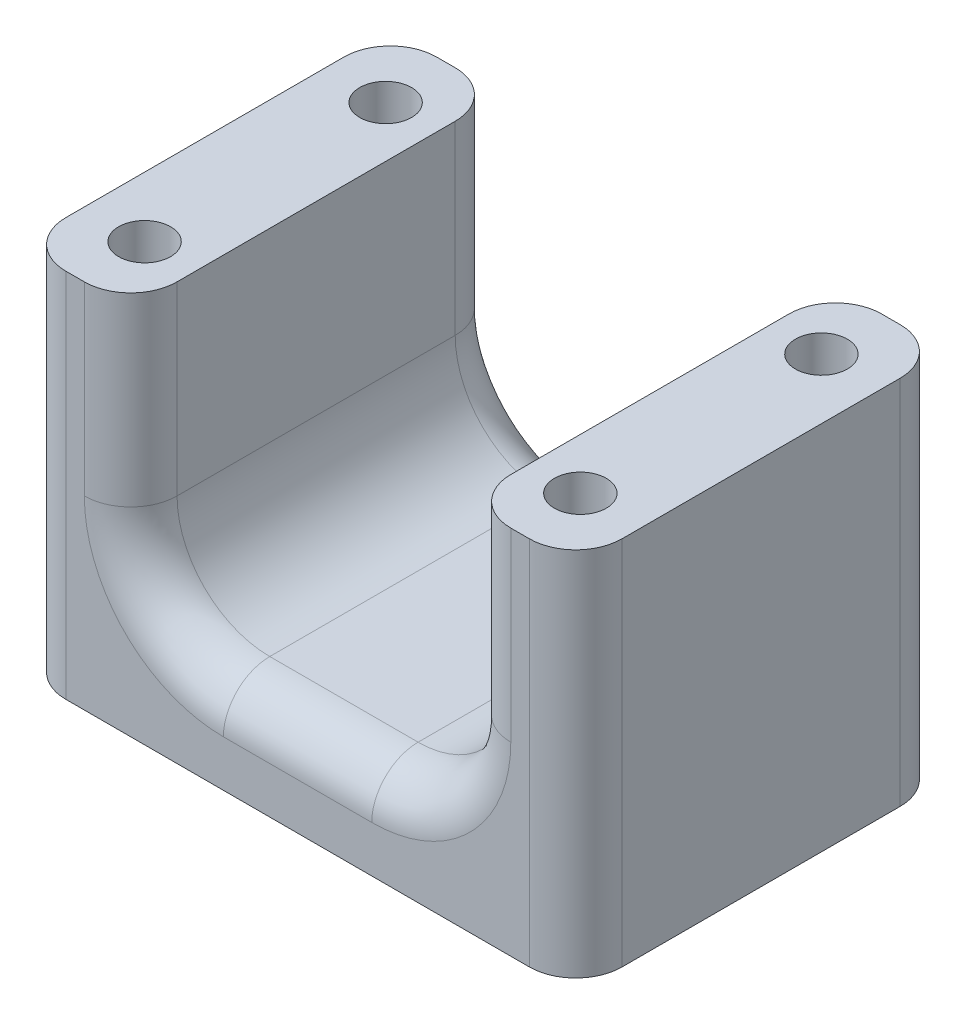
ISO-10303-21;
HEADER;
FILE_DESCRIPTION(('STEP AP214'),'2;1');
FILE_NAME('part.step','',(''),(''),'','','');
FILE_SCHEMA(('AUTOMOTIVE_DESIGN { 1 0 10303 214 1 1 1 1 }'));
ENDSEC;
DATA;
#1=APPLICATION_CONTEXT('core data for automotive mechanical design processes');
#2=APPLICATION_PROTOCOL_DEFINITION('international standard','automotive_design',2000,#1);
#3=PRODUCT_CONTEXT('',#1,'mechanical');
#4=PRODUCT('Part','Part','',(#3));
#5=PRODUCT_RELATED_PRODUCT_CATEGORY('part','',(#4));
#6=PRODUCT_DEFINITION_FORMATION('','',#4);
#7=PRODUCT_DEFINITION_CONTEXT('part definition',#1,'design');
#8=PRODUCT_DEFINITION('design','',#6,#7);
#9=PRODUCT_DEFINITION_SHAPE('','',#8);
#10=(LENGTH_UNIT() NAMED_UNIT(*) SI_UNIT(.MILLI.,.METRE.));
#11=(NAMED_UNIT(*) PLANE_ANGLE_UNIT() SI_UNIT($,.RADIAN.));
#12=(NAMED_UNIT(*) SI_UNIT($,.STERADIAN.) SOLID_ANGLE_UNIT());
#13=UNCERTAINTY_MEASURE_WITH_UNIT(LENGTH_MEASURE(1.E-05),#10,'distance_accuracy_value','');
#14=(GEOMETRIC_REPRESENTATION_CONTEXT(3) GLOBAL_UNCERTAINTY_ASSIGNED_CONTEXT((#13)) GLOBAL_UNIT_ASSIGNED_CONTEXT((#10,
#11,#12)) REPRESENTATION_CONTEXT('',''));
#15=CARTESIAN_POINT('',(0.,0.,0.));
#16=DIRECTION('',(0.,0.,1.));
#17=DIRECTION('',(1.,0.,0.));
#18=AXIS2_PLACEMENT_3D('',#15,#16,#17);
#19=CARTESIAN_POINT('',(0.,40.,0.));
#20=DIRECTION('',(0.,-1.,0.));
#21=DIRECTION('',(0.,0.,-1.));
#22=AXIS2_PLACEMENT_3D('',#19,#20,#21);
#23=PLANE('',#22);
#24=CARTESIAN_POINT('',(6.5,40.,-7.));
#25=DIRECTION('',(0.,1.,0.));
#26=DIRECTION('',(0.,0.,1.));
#27=AXIS2_PLACEMENT_3D('',#24,#25,#26);
#28=CIRCLE('',#27,2.8);
#29=CARTESIAN_POINT('',(6.5,40.,-4.2));
#30=VERTEX_POINT('',#29);
#31=EDGE_CURVE('E529',#30,#30,#28,.T.);
#32=ORIENTED_EDGE('',*,*,#31,.F.);
#33=EDGE_LOOP('',(#32));
#34=FACE_BOUND('',#33,.T.);
#35=CARTESIAN_POINT('',(6.49999999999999,40.,-33.));
#36=DIRECTION('',(0.,1.,0.));
#37=DIRECTION('',(0.,0.,1.));
#38=AXIS2_PLACEMENT_3D('',#35,#36,#37);
#39=CIRCLE('',#38,2.8);
#40=CARTESIAN_POINT('',(6.49999999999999,40.,-30.2));
#41=VERTEX_POINT('',#40);
#42=EDGE_CURVE('E528',#41,#41,#39,.T.);
#43=ORIENTED_EDGE('',*,*,#42,.F.);
#44=EDGE_LOOP('',(#43));
#45=FACE_BOUND('',#44,.T.);
#46=DIRECTION('',(0.,0.,1.));
#47=VECTOR('',#46,1.);
#48=CARTESIAN_POINT('',(12.,40.,-40.));
#49=LINE('',#48,#47);
#50=CARTESIAN_POINT('',(12.,40.,-35.));
#51=VERTEX_POINT('',#50);
#52=CARTESIAN_POINT('',(12.,40.,-5.00000000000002));
#53=VERTEX_POINT('',#52);
#54=EDGE_CURVE('E188',#51,#53,#49,.T.);
#55=ORIENTED_EDGE('',*,*,#54,.F.);
#56=CARTESIAN_POINT('',(7.,40.,-35.));
#57=DIRECTION('',(0.,-1.,0.));
#58=DIRECTION('',(0.,0.,-1.));
#59=AXIS2_PLACEMENT_3D('',#56,#57,#58);
#60=CIRCLE('',#59,5.);
#61=CARTESIAN_POINT('',(7.,40.,-40.));
#62=VERTEX_POINT('',#61);
#63=EDGE_CURVE('E183',#51,#62,#60,.F.);
#64=ORIENTED_EDGE('',*,*,#63,.T.);
#65=DIRECTION('',(-1.,0.,0.));
#66=VECTOR('',#65,1.);
#67=CARTESIAN_POINT('',(0.,40.,-40.));
#68=LINE('',#67,#66);
#69=CARTESIAN_POINT('',(5.,40.,-40.));
#70=VERTEX_POINT('',#69);
#71=EDGE_CURVE('E185',#62,#70,#68,.T.);
#72=ORIENTED_EDGE('',*,*,#71,.T.);
#73=CARTESIAN_POINT('',(5.,40.,-35.));
#74=DIRECTION('',(0.,-1.,0.));
#75=DIRECTION('',(0.,0.,-1.));
#76=AXIS2_PLACEMENT_3D('',#73,#74,#75);
#77=CIRCLE('',#76,5.);
#78=CARTESIAN_POINT('',(0.,40.,-35.));
#79=VERTEX_POINT('',#78);
#80=EDGE_CURVE('E265',#70,#79,#77,.F.);
#81=ORIENTED_EDGE('',*,*,#80,.T.);
#82=DIRECTION('',(0.,0.,1.));
#83=VECTOR('',#82,1.);
#84=CARTESIAN_POINT('',(0.,40.,0.));
#85=LINE('',#84,#83);
#86=CARTESIAN_POINT('',(0.,40.,-5.));
#87=VERTEX_POINT('',#86);
#88=EDGE_CURVE('E390',#79,#87,#85,.T.);
#89=ORIENTED_EDGE('',*,*,#88,.T.);
#90=CARTESIAN_POINT('',(5.,40.,-5.));
#91=DIRECTION('',(0.,-1.,0.));
#92=DIRECTION('',(0.,0.,-1.));
#93=AXIS2_PLACEMENT_3D('',#90,#91,#92);
#94=CIRCLE('',#93,5.);
#95=CARTESIAN_POINT('',(5.,40.,0.));
#96=VERTEX_POINT('',#95);
#97=EDGE_CURVE('E262',#87,#96,#94,.F.);
#98=ORIENTED_EDGE('',*,*,#97,.T.);
#99=DIRECTION('',(1.,0.,0.));
#100=VECTOR('',#99,1.);
#101=CARTESIAN_POINT('',(0.,40.,0.));
#102=LINE('',#101,#100);
#103=CARTESIAN_POINT('',(7.00000000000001,40.,0.));
#104=VERTEX_POINT('',#103);
#105=EDGE_CURVE('E396',#96,#104,#102,.T.);
#106=ORIENTED_EDGE('',*,*,#105,.T.);
#107=CARTESIAN_POINT('',(7.00000000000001,40.,-5.));
#108=DIRECTION('',(0.,-1.,0.));
#109=DIRECTION('',(0.,0.,-1.));
#110=AXIS2_PLACEMENT_3D('',#107,#108,#109);
#111=CIRCLE('',#110,5.);
#112=EDGE_CURVE('E194',#104,#53,#111,.F.);
#113=ORIENTED_EDGE('',*,*,#112,.T.);
#114=EDGE_LOOP('',(#55,#64,#72,#81,#89,#98,#106,#113));
#115=FACE_BOUND('',#114,.T.);
#116=ADVANCED_FACE('F41',(#34,#45,#115),#23,.F.);
#117=CARTESIAN_POINT('',(0.,40.,0.));
#118=DIRECTION('',(1.,0.,0.));
#119=DIRECTION('',(0.,0.,-1.));
#120=AXIS2_PLACEMENT_3D('',#117,#118,#119);
#121=PLANE('',#120);
#122=ORIENTED_EDGE('',*,*,#88,.F.);
#123=DIRECTION('',(0.,-1.,0.));
#124=VECTOR('',#123,1.);
#125=CARTESIAN_POINT('',(0.,40.,-35.));
#126=LINE('',#125,#124);
#127=CARTESIAN_POINT('',(0.,0.,-35.));
#128=VERTEX_POINT('',#127);
#129=EDGE_CURVE('E301',#79,#128,#126,.T.);
#130=ORIENTED_EDGE('',*,*,#129,.T.);
#131=DIRECTION('',(0.,0.,1.));
#132=VECTOR('',#131,1.);
#133=CARTESIAN_POINT('',(0.,0.,0.));
#134=LINE('',#133,#132);
#135=CARTESIAN_POINT('',(0.,0.,-5.));
#136=VERTEX_POINT('',#135);
#137=EDGE_CURVE('E379',#128,#136,#134,.T.);
#138=ORIENTED_EDGE('',*,*,#137,.T.);
#139=DIRECTION('',(0.,-1.,0.));
#140=VECTOR('',#139,1.);
#141=CARTESIAN_POINT('',(0.,40.,-5.));
#142=LINE('',#141,#140);
#143=EDGE_CURVE('E298',#136,#87,#142,.F.);
#144=ORIENTED_EDGE('',*,*,#143,.T.);
#145=EDGE_LOOP('',(#122,#130,#138,#144));
#146=FACE_BOUND('',#145,.T.);
#147=ADVANCED_FACE('F454',(#146),#121,.F.);
#148=CARTESIAN_POINT('',(0.,40.,0.));
#149=DIRECTION('',(0.,0.,-1.));
#150=DIRECTION('',(-1.,0.,0.));
#151=AXIS2_PLACEMENT_3D('',#148,#149,#150);
#152=PLANE('',#151);
#153=ORIENTED_EDGE('',*,*,#105,.F.);
#154=DIRECTION('',(0.,-1.,0.));
#155=VECTOR('',#154,1.);
#156=CARTESIAN_POINT('',(5.,40.,0.));
#157=LINE('',#156,#155);
#158=CARTESIAN_POINT('',(5.,0.,0.));
#159=VERTEX_POINT('',#158);
#160=EDGE_CURVE('E294',#96,#159,#157,.T.);
#161=ORIENTED_EDGE('',*,*,#160,.T.);
#162=DIRECTION('',(1.,0.,0.));
#163=VECTOR('',#162,1.);
#164=CARTESIAN_POINT('',(0.,0.,0.));
#165=LINE('',#164,#163);
#166=CARTESIAN_POINT('',(55.,0.,0.));
#167=VERTEX_POINT('',#166);
#168=EDGE_CURVE('E384',#159,#167,#165,.T.);
#169=ORIENTED_EDGE('',*,*,#168,.T.);
#170=DIRECTION('',(0.,-1.,0.));
#171=VECTOR('',#170,1.);
#172=CARTESIAN_POINT('',(55.,40.,0.));
#173=LINE('',#172,#171);
#174=CARTESIAN_POINT('',(55.,40.,0.));
#175=VERTEX_POINT('',#174);
#176=EDGE_CURVE('E291',#167,#175,#173,.F.);
#177=ORIENTED_EDGE('',*,*,#176,.T.);
#178=CARTESIAN_POINT('',(53.,40.,0.));
#179=VERTEX_POINT('',#178);
#180=EDGE_CURVE('E394',#179,#175,#102,.T.);
#181=ORIENTED_EDGE('',*,*,#180,.F.);
#182=DIRECTION('',(0.,1.,0.));
#183=VECTOR('',#182,1.);
#184=CARTESIAN_POINT('',(53.,40.,0.));
#185=LINE('',#184,#183);
#186=CARTESIAN_POINT('',(53.,20.,0.));
#187=VERTEX_POINT('',#186);
#188=EDGE_CURVE('E281',#179,#187,#185,.F.);
#189=ORIENTED_EDGE('',*,*,#188,.T.);
#190=CARTESIAN_POINT('',(38.,20.,0.));
#191=DIRECTION('',(0.,0.,-1.));
#192=DIRECTION('',(-1.,0.,0.));
#193=AXIS2_PLACEMENT_3D('',#190,#191,#192);
#194=CIRCLE('',#193,15.);
#195=CARTESIAN_POINT('',(38.,5.,0.));
#196=VERTEX_POINT('',#195);
#197=EDGE_CURVE('E278',#187,#196,#194,.T.);
#198=ORIENTED_EDGE('',*,*,#197,.T.);
#199=DIRECTION('',(1.,0.,0.));
#200=VECTOR('',#199,1.);
#201=CARTESIAN_POINT('',(22.,5.,0.));
#202=LINE('',#201,#200);
#203=CARTESIAN_POINT('',(22.,5.,0.));
#204=VERTEX_POINT('',#203);
#205=EDGE_CURVE('E275',#196,#204,#202,.F.);
#206=ORIENTED_EDGE('',*,*,#205,.T.);
#207=CARTESIAN_POINT('',(22.,20.,0.));
#208=DIRECTION('',(0.,0.,-1.));
#209=DIRECTION('',(-1.,0.,0.));
#210=AXIS2_PLACEMENT_3D('',#207,#208,#209);
#211=CIRCLE('',#210,15.);
#212=CARTESIAN_POINT('',(7.00000000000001,20.,0.));
#213=VERTEX_POINT('',#212);
#214=EDGE_CURVE('E284',#204,#213,#211,.T.);
#215=ORIENTED_EDGE('',*,*,#214,.T.);
#216=DIRECTION('',(0.,1.,0.));
#217=VECTOR('',#216,1.);
#218=CARTESIAN_POINT('',(7.00000000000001,40.,0.));
#219=LINE('',#218,#217);
#220=EDGE_CURVE('E287',#213,#104,#219,.T.);
#221=ORIENTED_EDGE('',*,*,#220,.T.);
#222=EDGE_LOOP('',(#153,#161,#169,#177,#181,#189,#198,#206,#215,#221));
#223=FACE_BOUND('',#222,.T.);
#224=ADVANCED_FACE('F463',(#223),#152,.F.);
#225=CARTESIAN_POINT('',(60.,40.,0.));
#226=DIRECTION('',(-1.,0.,0.));
#227=DIRECTION('',(0.,0.,1.));
#228=AXIS2_PLACEMENT_3D('',#225,#226,#227);
#229=PLANE('',#228);
#230=DIRECTION('',(0.,0.,-1.));
#231=VECTOR('',#230,1.);
#232=CARTESIAN_POINT('',(60.,0.,0.));
#233=LINE('',#232,#231);
#234=CARTESIAN_POINT('',(60.,0.,-5.));
#235=VERTEX_POINT('',#234);
#236=CARTESIAN_POINT('',(60.,0.,-35.));
#237=VERTEX_POINT('',#236);
#238=EDGE_CURVE('E408',#235,#237,#233,.T.);
#239=ORIENTED_EDGE('',*,*,#238,.T.);
#240=DIRECTION('',(0.,-1.,0.));
#241=VECTOR('',#240,1.);
#242=CARTESIAN_POINT('',(60.,40.,-35.));
#243=LINE('',#242,#241);
#244=CARTESIAN_POINT('',(60.,40.,-35.));
#245=VERTEX_POINT('',#244);
#246=EDGE_CURVE('E318',#237,#245,#243,.F.);
#247=ORIENTED_EDGE('',*,*,#246,.T.);
#248=DIRECTION('',(0.,0.,-1.));
#249=VECTOR('',#248,1.);
#250=CARTESIAN_POINT('',(60.,40.,0.));
#251=LINE('',#250,#249);
#252=CARTESIAN_POINT('',(60.,40.,-5.));
#253=VERTEX_POINT('',#252);
#254=EDGE_CURVE('E205',#253,#245,#251,.T.);
#255=ORIENTED_EDGE('',*,*,#254,.F.);
#256=DIRECTION('',(0.,-1.,0.));
#257=VECTOR('',#256,1.);
#258=CARTESIAN_POINT('',(60.,40.,-5.));
#259=LINE('',#258,#257);
#260=EDGE_CURVE('E315',#253,#235,#259,.T.);
#261=ORIENTED_EDGE('',*,*,#260,.T.);
#262=EDGE_LOOP('',(#239,#247,#255,#261));
#263=FACE_BOUND('',#262,.T.);
#264=ADVANCED_FACE('F465',(#263),#229,.F.);
#265=CARTESIAN_POINT('',(0.,40.,-40.));
#266=DIRECTION('',(0.,0.,1.));
#267=DIRECTION('',(1.,0.,0.));
#268=AXIS2_PLACEMENT_3D('',#265,#266,#267);
#269=PLANE('',#268);
#270=DIRECTION('',(-1.,0.,0.));
#271=VECTOR('',#270,1.);
#272=CARTESIAN_POINT('',(0.,0.,-40.));
#273=LINE('',#272,#271);
#274=CARTESIAN_POINT('',(55.,0.,-40.));
#275=VERTEX_POINT('',#274);
#276=CARTESIAN_POINT('',(5.,0.,-40.));
#277=VERTEX_POINT('',#276);
#278=EDGE_CURVE('E395',#275,#277,#273,.T.);
#279=ORIENTED_EDGE('',*,*,#278,.T.);
#280=DIRECTION('',(0.,-1.,0.));
#281=VECTOR('',#280,1.);
#282=CARTESIAN_POINT('',(5.,40.,-40.));
#283=LINE('',#282,#281);
#284=EDGE_CURVE('E202',#277,#70,#283,.F.);
#285=ORIENTED_EDGE('',*,*,#284,.T.);
#286=ORIENTED_EDGE('',*,*,#71,.F.);
#287=DIRECTION('',(0.,1.,0.));
#288=VECTOR('',#287,1.);
#289=CARTESIAN_POINT('',(7.,40.,-40.));
#290=LINE('',#289,#288);
#291=CARTESIAN_POINT('',(7.,20.,-40.));
#292=VERTEX_POINT('',#291);
#293=EDGE_CURVE('E199',#62,#292,#290,.F.);
#294=ORIENTED_EDGE('',*,*,#293,.T.);
#295=CARTESIAN_POINT('',(22.,20.,-40.));
#296=DIRECTION('',(0.,0.,1.));
#297=DIRECTION('',(1.,0.,0.));
#298=AXIS2_PLACEMENT_3D('',#295,#296,#297);
#299=CIRCLE('',#298,15.);
#300=CARTESIAN_POINT('',(22.,5.,-40.));
#301=VERTEX_POINT('',#300);
#302=EDGE_CURVE('E213',#292,#301,#299,.T.);
#303=ORIENTED_EDGE('',*,*,#302,.T.);
#304=DIRECTION('',(-1.,0.,0.));
#305=VECTOR('',#304,1.);
#306=CARTESIAN_POINT('',(38.,5.,-40.));
#307=LINE('',#306,#305);
#308=CARTESIAN_POINT('',(38.,5.,-40.));
#309=VERTEX_POINT('',#308);
#310=EDGE_CURVE('E219',#301,#309,#307,.F.);
#311=ORIENTED_EDGE('',*,*,#310,.T.);
#312=CARTESIAN_POINT('',(38.,20.,-40.));
#313=DIRECTION('',(0.,0.,1.));
#314=DIRECTION('',(1.,0.,0.));
#315=AXIS2_PLACEMENT_3D('',#312,#313,#314);
#316=CIRCLE('',#315,15.);
#317=CARTESIAN_POINT('',(53.,20.,-40.));
#318=VERTEX_POINT('',#317);
#319=EDGE_CURVE('E212',#309,#318,#316,.T.);
#320=ORIENTED_EDGE('',*,*,#319,.T.);
#321=DIRECTION('',(0.,1.,0.));
#322=VECTOR('',#321,1.);
#323=CARTESIAN_POINT('',(53.,40.,-40.));
#324=LINE('',#323,#322);
#325=CARTESIAN_POINT('',(53.,40.,-40.));
#326=VERTEX_POINT('',#325);
#327=EDGE_CURVE('E217',#318,#326,#324,.T.);
#328=ORIENTED_EDGE('',*,*,#327,.T.);
#329=CARTESIAN_POINT('',(55.,40.,-40.));
#330=VERTEX_POINT('',#329);
#331=EDGE_CURVE('E204',#330,#326,#68,.T.);
#332=ORIENTED_EDGE('',*,*,#331,.F.);
#333=DIRECTION('',(0.,-1.,0.));
#334=VECTOR('',#333,1.);
#335=CARTESIAN_POINT('',(55.,40.,-40.));
#336=LINE('',#335,#334);
#337=EDGE_CURVE('E226',#330,#275,#336,.T.);
#338=ORIENTED_EDGE('',*,*,#337,.T.);
#339=EDGE_LOOP('',(#279,#285,#286,#294,#303,#311,#320,#328,#332,#338));
#340=FACE_BOUND('',#339,.T.);
#341=ADVANCED_FACE('F198',(#340),#269,.F.);
#342=CARTESIAN_POINT('',(53.5,40.,-33.));
#343=DIRECTION('',(0.,1.,0.));
#344=DIRECTION('',(0.,0.,1.));
#345=AXIS2_PLACEMENT_3D('',#342,#343,#344);
#346=CIRCLE('',#345,2.8);
#347=CARTESIAN_POINT('',(53.5,40.,-30.2));
#348=VERTEX_POINT('',#347);
#349=EDGE_CURVE('E513',#348,#348,#346,.T.);
#350=ORIENTED_EDGE('',*,*,#349,.F.);
#351=EDGE_LOOP('',(#350));
#352=FACE_BOUND('',#351,.T.);
#353=CARTESIAN_POINT('',(53.5,40.,-7.));
#354=DIRECTION('',(0.,1.,0.));
#355=DIRECTION('',(0.,0.,1.));
#356=AXIS2_PLACEMENT_3D('',#353,#354,#355);
#357=CIRCLE('',#356,2.8);
#358=CARTESIAN_POINT('',(53.5,40.,-4.2));
#359=VERTEX_POINT('',#358);
#360=EDGE_CURVE('E337',#359,#359,#357,.T.);
#361=ORIENTED_EDGE('',*,*,#360,.F.);
#362=EDGE_LOOP('',(#361));
#363=FACE_BOUND('',#362,.T.);
#364=ORIENTED_EDGE('',*,*,#331,.T.);
#365=CARTESIAN_POINT('',(53.,40.,-35.));
#366=DIRECTION('',(0.,-1.,0.));
#367=DIRECTION('',(0.,0.,-1.));
#368=AXIS2_PLACEMENT_3D('',#365,#366,#367);
#369=CIRCLE('',#368,5.);
#370=CARTESIAN_POINT('',(48.,40.,-35.));
#371=VERTEX_POINT('',#370);
#372=EDGE_CURVE('E241',#326,#371,#369,.F.);
#373=ORIENTED_EDGE('',*,*,#372,.T.);
#374=DIRECTION('',(0.,0.,-1.));
#375=VECTOR('',#374,1.);
#376=CARTESIAN_POINT('',(48.,40.,-40.));
#377=LINE('',#376,#375);
#378=CARTESIAN_POINT('',(48.,40.,-5.00000000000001));
#379=VERTEX_POINT('',#378);
#380=EDGE_CURVE('E369',#379,#371,#377,.T.);
#381=ORIENTED_EDGE('',*,*,#380,.F.);
#382=CARTESIAN_POINT('',(53.,40.,-5.));
#383=DIRECTION('',(0.,-1.,0.));
#384=DIRECTION('',(0.,0.,-1.));
#385=AXIS2_PLACEMENT_3D('',#382,#383,#384);
#386=CIRCLE('',#385,5.);
#387=EDGE_CURVE('E238',#379,#179,#386,.F.);
#388=ORIENTED_EDGE('',*,*,#387,.T.);
#389=ORIENTED_EDGE('',*,*,#180,.T.);
#390=CARTESIAN_POINT('',(55.,40.,-5.));
#391=DIRECTION('',(0.,-1.,0.));
#392=DIRECTION('',(0.,0.,-1.));
#393=AXIS2_PLACEMENT_3D('',#390,#391,#392);
#394=CIRCLE('',#393,5.);
#395=EDGE_CURVE('E232',#175,#253,#394,.F.);
#396=ORIENTED_EDGE('',*,*,#395,.T.);
#397=ORIENTED_EDGE('',*,*,#254,.T.);
#398=CARTESIAN_POINT('',(55.,40.,-35.));
#399=DIRECTION('',(0.,-1.,0.));
#400=DIRECTION('',(0.,0.,-1.));
#401=AXIS2_PLACEMENT_3D('',#398,#399,#400);
#402=CIRCLE('',#401,5.);
#403=EDGE_CURVE('E235',#245,#330,#402,.F.);
#404=ORIENTED_EDGE('',*,*,#403,.T.);
#405=EDGE_LOOP('',(#364,#373,#381,#388,#389,#396,#397,#404));
#406=FACE_BOUND('',#405,.T.);
#407=ADVANCED_FACE('F375',(#352,#363,#406),#23,.F.);
#408=CARTESIAN_POINT('',(0.,0.,0.));
#409=DIRECTION('',(0.,-1.,0.));
#410=DIRECTION('',(0.,0.,-1.));
#411=AXIS2_PLACEMENT_3D('',#408,#409,#410);
#412=PLANE('',#411);
#413=CARTESIAN_POINT('',(6.5,0.,-7.));
#414=DIRECTION('',(0.,1.,0.));
#415=DIRECTION('',(0.,0.,1.));
#416=AXIS2_PLACEMENT_3D('',#413,#414,#415);
#417=CIRCLE('',#416,2.8);
#418=CARTESIAN_POINT('',(6.5,0.,-4.2));
#419=VERTEX_POINT('',#418);
#420=EDGE_CURVE('E524',#419,#419,#417,.T.);
#421=ORIENTED_EDGE('',*,*,#420,.T.);
#422=EDGE_LOOP('',(#421));
#423=FACE_BOUND('',#422,.T.);
#424=CARTESIAN_POINT('',(53.5,0.,-33.));
#425=DIRECTION('',(0.,1.,0.));
#426=DIRECTION('',(0.,0.,1.));
#427=AXIS2_PLACEMENT_3D('',#424,#425,#426);
#428=CIRCLE('',#427,2.8);
#429=CARTESIAN_POINT('',(53.5,0.,-30.2));
#430=VERTEX_POINT('',#429);
#431=EDGE_CURVE('E533',#430,#430,#428,.T.);
#432=ORIENTED_EDGE('',*,*,#431,.T.);
#433=EDGE_LOOP('',(#432));
#434=FACE_BOUND('',#433,.T.);
#435=CARTESIAN_POINT('',(53.5,0.,-7.));
#436=DIRECTION('',(0.,1.,0.));
#437=DIRECTION('',(0.,0.,1.));
#438=AXIS2_PLACEMENT_3D('',#435,#436,#437);
#439=CIRCLE('',#438,2.8);
#440=CARTESIAN_POINT('',(53.5,0.,-4.2));
#441=VERTEX_POINT('',#440);
#442=EDGE_CURVE('E518',#441,#441,#439,.T.);
#443=ORIENTED_EDGE('',*,*,#442,.T.);
#444=EDGE_LOOP('',(#443));
#445=FACE_BOUND('',#444,.T.);
#446=CARTESIAN_POINT('',(6.49999999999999,0.,-33.));
#447=DIRECTION('',(0.,1.,0.));
#448=DIRECTION('',(0.,0.,1.));
#449=AXIS2_PLACEMENT_3D('',#446,#447,#448);
#450=CIRCLE('',#449,2.8);
#451=CARTESIAN_POINT('',(6.49999999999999,0.,-30.2));
#452=VERTEX_POINT('',#451);
#453=EDGE_CURVE('E386',#452,#452,#450,.T.);
#454=ORIENTED_EDGE('',*,*,#453,.T.);
#455=EDGE_LOOP('',(#454));
#456=FACE_BOUND('',#455,.T.);
#457=ORIENTED_EDGE('',*,*,#137,.F.);
#458=CARTESIAN_POINT('',(5.,0.,-35.));
#459=DIRECTION('',(0.,-1.,0.));
#460=DIRECTION('',(0.,0.,-1.));
#461=AXIS2_PLACEMENT_3D('',#458,#459,#460);
#462=CIRCLE('',#461,5.);
#463=EDGE_CURVE('E312',#128,#277,#462,.T.);
#464=ORIENTED_EDGE('',*,*,#463,.T.);
#465=ORIENTED_EDGE('',*,*,#278,.F.);
#466=CARTESIAN_POINT('',(55.,0.,-35.));
#467=DIRECTION('',(0.,-1.,0.));
#468=DIRECTION('',(0.,0.,-1.));
#469=AXIS2_PLACEMENT_3D('',#466,#467,#468);
#470=CIRCLE('',#469,5.);
#471=EDGE_CURVE('E59',#275,#237,#470,.T.);
#472=ORIENTED_EDGE('',*,*,#471,.T.);
#473=ORIENTED_EDGE('',*,*,#238,.F.);
#474=CARTESIAN_POINT('',(55.,0.,-5.));
#475=DIRECTION('',(0.,-1.,0.));
#476=DIRECTION('',(0.,0.,-1.));
#477=AXIS2_PLACEMENT_3D('',#474,#475,#476);
#478=CIRCLE('',#477,5.);
#479=EDGE_CURVE('E67',#235,#167,#478,.T.);
#480=ORIENTED_EDGE('',*,*,#479,.T.);
#481=ORIENTED_EDGE('',*,*,#168,.F.);
#482=CARTESIAN_POINT('',(5.,0.,-5.));
#483=DIRECTION('',(0.,-1.,0.));
#484=DIRECTION('',(0.,0.,-1.));
#485=AXIS2_PLACEMENT_3D('',#482,#483,#484);
#486=CIRCLE('',#485,5.);
#487=EDGE_CURVE('E309',#159,#136,#486,.T.);
#488=ORIENTED_EDGE('',*,*,#487,.T.);
#489=EDGE_LOOP('',(#457,#464,#465,#472,#473,#480,#481,#488));
#490=FACE_BOUND('',#489,.T.);
#491=ADVANCED_FACE('F448',(#423,#434,#445,#456,#490),#412,.T.);
#492=CARTESIAN_POINT('',(12.,10.,-40.));
#493=DIRECTION('',(-1.,0.,0.));
#494=DIRECTION('',(0.,0.,1.));
#495=AXIS2_PLACEMENT_3D('',#492,#493,#494);
#496=PLANE('',#495);
#497=DIRECTION('',(0.,0.,1.));
#498=VECTOR('',#497,1.);
#499=CARTESIAN_POINT('',(12.,20.,-40.));
#500=LINE('',#499,#498);
#501=CARTESIAN_POINT('',(12.,20.,-5.));
#502=VERTEX_POINT('',#501);
#503=CARTESIAN_POINT('',(12.,20.,-35.));
#504=VERTEX_POINT('',#503);
#505=EDGE_CURVE('E422',#502,#504,#500,.F.);
#506=ORIENTED_EDGE('',*,*,#505,.T.);
#507=DIRECTION('',(0.,1.,0.));
#508=VECTOR('',#507,1.);
#509=CARTESIAN_POINT('',(12.,10.,-35.));
#510=LINE('',#509,#508);
#511=EDGE_CURVE('E259',#504,#51,#510,.T.);
#512=ORIENTED_EDGE('',*,*,#511,.T.);
#513=ORIENTED_EDGE('',*,*,#54,.T.);
#514=DIRECTION('',(0.,1.,0.));
#515=VECTOR('',#514,1.);
#516=CARTESIAN_POINT('',(12.,10.,-5.));
#517=LINE('',#516,#515);
#518=EDGE_CURVE('E256',#53,#502,#517,.F.);
#519=ORIENTED_EDGE('',*,*,#518,.T.);
#520=EDGE_LOOP('',(#506,#512,#513,#519));
#521=FACE_BOUND('',#520,.T.);
#522=ADVANCED_FACE('F479',(#521),#496,.F.);
#523=CARTESIAN_POINT('',(48.,10.,-40.));
#524=DIRECTION('',(1.,0.,0.));
#525=DIRECTION('',(0.,0.,-1.));
#526=AXIS2_PLACEMENT_3D('',#523,#524,#525);
#527=PLANE('',#526);
#528=ORIENTED_EDGE('',*,*,#380,.T.);
#529=DIRECTION('',(0.,1.,0.));
#530=VECTOR('',#529,1.);
#531=CARTESIAN_POINT('',(48.,10.,-35.));
#532=LINE('',#531,#530);
#533=CARTESIAN_POINT('',(48.,20.,-35.));
#534=VERTEX_POINT('',#533);
#535=EDGE_CURVE('E247',#371,#534,#532,.F.);
#536=ORIENTED_EDGE('',*,*,#535,.T.);
#537=DIRECTION('',(0.,0.,-1.));
#538=VECTOR('',#537,1.);
#539=CARTESIAN_POINT('',(48.,20.,-40.));
#540=LINE('',#539,#538);
#541=CARTESIAN_POINT('',(48.,20.,-5.));
#542=VERTEX_POINT('',#541);
#543=EDGE_CURVE('E372',#534,#542,#540,.F.);
#544=ORIENTED_EDGE('',*,*,#543,.T.);
#545=DIRECTION('',(0.,1.,0.));
#546=VECTOR('',#545,1.);
#547=CARTESIAN_POINT('',(48.,10.,-5.));
#548=LINE('',#547,#546);
#549=EDGE_CURVE('E244',#542,#379,#548,.T.);
#550=ORIENTED_EDGE('',*,*,#549,.T.);
#551=EDGE_LOOP('',(#528,#536,#544,#550));
#552=FACE_BOUND('',#551,.T.);
#553=ADVANCED_FACE('F368',(#552),#527,.F.);
#554=CARTESIAN_POINT('',(0.,10.,0.));
#555=DIRECTION('',(0.,1.,0.));
#556=DIRECTION('',(0.,0.,1.));
#557=AXIS2_PLACEMENT_3D('',#554,#555,#556);
#558=PLANE('',#557);
#559=DIRECTION('',(0.,0.,-1.));
#560=VECTOR('',#559,1.);
#561=CARTESIAN_POINT('',(38.,10.,0.));
#562=LINE('',#561,#560);
#563=CARTESIAN_POINT('',(38.,10.,-5.));
#564=VERTEX_POINT('',#563);
#565=CARTESIAN_POINT('',(38.,10.,-35.));
#566=VERTEX_POINT('',#565);
#567=EDGE_CURVE('E416',#564,#566,#562,.T.);
#568=ORIENTED_EDGE('',*,*,#567,.T.);
#569=DIRECTION('',(-1.,0.,0.));
#570=VECTOR('',#569,1.);
#571=CARTESIAN_POINT('',(22.,10.,-35.));
#572=LINE('',#571,#570);
#573=CARTESIAN_POINT('',(22.,10.,-35.));
#574=VERTEX_POINT('',#573);
#575=EDGE_CURVE('E11',#566,#574,#572,.T.);
#576=ORIENTED_EDGE('',*,*,#575,.T.);
#577=DIRECTION('',(0.,0.,1.));
#578=VECTOR('',#577,1.);
#579=CARTESIAN_POINT('',(22.,10.,0.));
#580=LINE('',#579,#578);
#581=CARTESIAN_POINT('',(22.,10.,-5.));
#582=VERTEX_POINT('',#581);
#583=EDGE_CURVE('E403',#574,#582,#580,.T.);
#584=ORIENTED_EDGE('',*,*,#583,.T.);
#585=DIRECTION('',(1.,0.,0.));
#586=VECTOR('',#585,1.);
#587=CARTESIAN_POINT('',(38.,10.,-5.));
#588=LINE('',#587,#586);
#589=EDGE_CURVE('E51',#582,#564,#588,.T.);
#590=ORIENTED_EDGE('',*,*,#589,.T.);
#591=EDGE_LOOP('',(#568,#576,#584,#590));
#592=FACE_BOUND('',#591,.T.);
#593=ADVANCED_FACE('F548',(#592),#558,.T.);
#594=CARTESIAN_POINT('',(6.49999999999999,0.,-33.));
#595=DIRECTION('',(0.,1.,0.));
#596=DIRECTION('',(0.,0.,1.));
#597=AXIS2_PLACEMENT_3D('',#594,#595,#596);
#598=CYLINDRICAL_SURFACE('',#597,2.8);
#599=ORIENTED_EDGE('',*,*,#453,.F.);
#600=EDGE_LOOP('',(#599));
#601=FACE_BOUND('',#600,.T.);
#602=ORIENTED_EDGE('',*,*,#42,.T.);
#603=EDGE_LOOP('',(#602));
#604=FACE_BOUND('',#603,.T.);
#605=ADVANCED_FACE('F545',(#601,#604),#598,.F.);
#606=CARTESIAN_POINT('',(53.5,0.,-7.));
#607=DIRECTION('',(0.,1.,0.));
#608=DIRECTION('',(0.,0.,1.));
#609=AXIS2_PLACEMENT_3D('',#606,#607,#608);
#610=CYLINDRICAL_SURFACE('',#609,2.8);
#611=ORIENTED_EDGE('',*,*,#442,.F.);
#612=EDGE_LOOP('',(#611));
#613=FACE_BOUND('',#612,.T.);
#614=ORIENTED_EDGE('',*,*,#360,.T.);
#615=EDGE_LOOP('',(#614));
#616=FACE_BOUND('',#615,.T.);
#617=ADVANCED_FACE('F547',(#613,#616),#610,.F.);
#618=CARTESIAN_POINT('',(53.5,0.,-33.));
#619=DIRECTION('',(0.,1.,0.));
#620=DIRECTION('',(0.,0.,1.));
#621=AXIS2_PLACEMENT_3D('',#618,#619,#620);
#622=CYLINDRICAL_SURFACE('',#621,2.8);
#623=ORIENTED_EDGE('',*,*,#431,.F.);
#624=EDGE_LOOP('',(#623));
#625=FACE_BOUND('',#624,.T.);
#626=ORIENTED_EDGE('',*,*,#349,.T.);
#627=EDGE_LOOP('',(#626));
#628=FACE_BOUND('',#627,.T.);
#629=ADVANCED_FACE('F555',(#625,#628),#622,.F.);
#630=CARTESIAN_POINT('',(6.5,0.,-7.));
#631=DIRECTION('',(0.,1.,0.));
#632=DIRECTION('',(0.,0.,1.));
#633=AXIS2_PLACEMENT_3D('',#630,#631,#632);
#634=CYLINDRICAL_SURFACE('',#633,2.8);
#635=ORIENTED_EDGE('',*,*,#420,.F.);
#636=EDGE_LOOP('',(#635));
#637=FACE_BOUND('',#636,.T.);
#638=ORIENTED_EDGE('',*,*,#31,.T.);
#639=EDGE_LOOP('',(#638));
#640=FACE_BOUND('',#639,.T.);
#641=ADVANCED_FACE('F590',(#637,#640),#634,.F.);
#642=CARTESIAN_POINT('',(38.,20.,0.));
#643=DIRECTION('',(0.,0.,-1.));
#644=DIRECTION('',(-1.,0.,0.));
#645=AXIS2_PLACEMENT_3D('',#642,#643,#644);
#646=CYLINDRICAL_SURFACE('',#645,10.);
#647=ORIENTED_EDGE('',*,*,#543,.F.);
#648=CARTESIAN_POINT('',(38.,20.,-35.));
#649=DIRECTION('',(0.,0.,1.));
#650=DIRECTION('',(1.,0.,0.));
#651=AXIS2_PLACEMENT_3D('',#648,#649,#650);
#652=CIRCLE('',#651,10.);
#653=EDGE_CURVE('E253',#534,#566,#652,.F.);
#654=ORIENTED_EDGE('',*,*,#653,.T.);
#655=ORIENTED_EDGE('',*,*,#567,.F.);
#656=CARTESIAN_POINT('',(38.,20.,-5.));
#657=DIRECTION('',(0.,0.,-1.));
#658=DIRECTION('',(-1.,0.,0.));
#659=AXIS2_PLACEMENT_3D('',#656,#657,#658);
#660=CIRCLE('',#659,10.);
#661=EDGE_CURVE('E250',#564,#542,#660,.F.);
#662=ORIENTED_EDGE('',*,*,#661,.T.);
#663=EDGE_LOOP('',(#647,#654,#655,#662));
#664=FACE_BOUND('',#663,.T.);
#665=ADVANCED_FACE('F584',(#664),#646,.F.);
#666=CARTESIAN_POINT('',(22.,20.,0.));
#667=DIRECTION('',(0.,0.,1.));
#668=DIRECTION('',(1.,0.,0.));
#669=AXIS2_PLACEMENT_3D('',#666,#667,#668);
#670=CYLINDRICAL_SURFACE('',#669,10.);
#671=ORIENTED_EDGE('',*,*,#583,.F.);
#672=CARTESIAN_POINT('',(22.,20.,-35.));
#673=DIRECTION('',(0.,0.,1.));
#674=DIRECTION('',(1.,0.,0.));
#675=AXIS2_PLACEMENT_3D('',#672,#673,#674);
#676=CIRCLE('',#675,10.);
#677=EDGE_CURVE('E272',#574,#504,#676,.F.);
#678=ORIENTED_EDGE('',*,*,#677,.T.);
#679=ORIENTED_EDGE('',*,*,#505,.F.);
#680=CARTESIAN_POINT('',(22.,20.,-5.));
#681=DIRECTION('',(0.,0.,-1.));
#682=DIRECTION('',(-1.,0.,0.));
#683=AXIS2_PLACEMENT_3D('',#680,#681,#682);
#684=CIRCLE('',#683,10.);
#685=EDGE_CURVE('E193',#502,#582,#684,.F.);
#686=ORIENTED_EDGE('',*,*,#685,.T.);
#687=EDGE_LOOP('',(#671,#678,#679,#686));
#688=FACE_BOUND('',#687,.T.);
#689=ADVANCED_FACE('F589',(#688),#670,.F.);
#690=CARTESIAN_POINT('',(7.,10.,-35.));
#691=DIRECTION('',(0.,1.,0.));
#692=DIRECTION('',(0.,0.,1.));
#693=AXIS2_PLACEMENT_3D('',#690,#691,#692);
#694=CYLINDRICAL_SURFACE('',#693,5.);
#695=ORIENTED_EDGE('',*,*,#63,.F.);
#696=ORIENTED_EDGE('',*,*,#511,.F.);
#697=CARTESIAN_POINT('',(7.,20.,-35.));
#698=DIRECTION('',(0.,-1.,0.));
#699=DIRECTION('',(0.,0.,-1.));
#700=AXIS2_PLACEMENT_3D('',#697,#698,#699);
#701=CIRCLE('',#700,5.);
#702=EDGE_CURVE('E209',#292,#504,#701,.T.);
#703=ORIENTED_EDGE('',*,*,#702,.F.);
#704=ORIENTED_EDGE('',*,*,#293,.F.);
#705=EDGE_LOOP('',(#695,#696,#703,#704));
#706=FACE_BOUND('',#705,.T.);
#707=ADVANCED_FACE('F207',(#706),#694,.T.);
#708=CARTESIAN_POINT('',(22.,20.,-35.));
#709=DIRECTION('',(0.,0.,1.));
#710=DIRECTION('',(1.,0.,0.));
#711=AXIS2_PLACEMENT_3D('',#708,#709,#710);
#712=TOROIDAL_SURFACE('',#711,15.,5.);
#713=ORIENTED_EDGE('',*,*,#702,.T.);
#714=ORIENTED_EDGE('',*,*,#677,.F.);
#715=CARTESIAN_POINT('',(22.,5.00000000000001,-35.));
#716=DIRECTION('',(1.,0.,0.));
#717=DIRECTION('',(0.,0.,-1.));
#718=AXIS2_PLACEMENT_3D('',#715,#716,#717);
#719=CIRCLE('',#718,5.);
#720=EDGE_CURVE('E331',#301,#574,#719,.T.);
#721=ORIENTED_EDGE('',*,*,#720,.F.);
#722=ORIENTED_EDGE('',*,*,#302,.F.);
#723=EDGE_LOOP('',(#713,#714,#721,#722));
#724=FACE_BOUND('',#723,.T.);
#725=ADVANCED_FACE('F611',(#724),#712,.T.);
#726=CARTESIAN_POINT('',(0.,5.,-35.));
#727=DIRECTION('',(1.,0.,0.));
#728=DIRECTION('',(0.,0.,-1.));
#729=AXIS2_PLACEMENT_3D('',#726,#727,#728);
#730=CYLINDRICAL_SURFACE('',#729,5.);
#731=ORIENTED_EDGE('',*,*,#720,.T.);
#732=ORIENTED_EDGE('',*,*,#575,.F.);
#733=CARTESIAN_POINT('',(38.,5.,-35.));
#734=DIRECTION('',(1.,0.,0.));
#735=DIRECTION('',(0.,0.,-1.));
#736=AXIS2_PLACEMENT_3D('',#733,#734,#735);
#737=CIRCLE('',#736,5.);
#738=EDGE_CURVE('E327',#309,#566,#737,.T.);
#739=ORIENTED_EDGE('',*,*,#738,.F.);
#740=ORIENTED_EDGE('',*,*,#310,.F.);
#741=EDGE_LOOP('',(#731,#732,#739,#740));
#742=FACE_BOUND('',#741,.T.);
#743=ADVANCED_FACE('F433',(#742),#730,.T.);
#744=CARTESIAN_POINT('',(38.,20.,-35.));
#745=DIRECTION('',(0.,0.,1.));
#746=DIRECTION('',(1.,0.,0.));
#747=AXIS2_PLACEMENT_3D('',#744,#745,#746);
#748=TOROIDAL_SURFACE('',#747,15.,5.);
#749=ORIENTED_EDGE('',*,*,#738,.T.);
#750=ORIENTED_EDGE('',*,*,#653,.F.);
#751=CARTESIAN_POINT('',(53.,20.,-35.));
#752=DIRECTION('',(0.,1.,0.));
#753=DIRECTION('',(0.,0.,1.));
#754=AXIS2_PLACEMENT_3D('',#751,#752,#753);
#755=CIRCLE('',#754,5.);
#756=EDGE_CURVE('E323',#318,#534,#755,.T.);
#757=ORIENTED_EDGE('',*,*,#756,.F.);
#758=ORIENTED_EDGE('',*,*,#319,.F.);
#759=EDGE_LOOP('',(#749,#750,#757,#758));
#760=FACE_BOUND('',#759,.T.);
#761=ADVANCED_FACE('F436',(#760),#748,.T.);
#762=CARTESIAN_POINT('',(53.,40.,-35.));
#763=DIRECTION('',(0.,1.,0.));
#764=DIRECTION('',(0.,0.,1.));
#765=AXIS2_PLACEMENT_3D('',#762,#763,#764);
#766=CYLINDRICAL_SURFACE('',#765,5.);
#767=ORIENTED_EDGE('',*,*,#756,.T.);
#768=ORIENTED_EDGE('',*,*,#535,.F.);
#769=ORIENTED_EDGE('',*,*,#372,.F.);
#770=ORIENTED_EDGE('',*,*,#327,.F.);
#771=EDGE_LOOP('',(#767,#768,#769,#770));
#772=FACE_BOUND('',#771,.T.);
#773=ADVANCED_FACE('F439',(#772),#766,.T.);
#774=CARTESIAN_POINT('',(53.,10.,-5.));
#775=DIRECTION('',(0.,1.,0.));
#776=DIRECTION('',(0.,0.,1.));
#777=AXIS2_PLACEMENT_3D('',#774,#775,#776);
#778=CYLINDRICAL_SURFACE('',#777,5.);
#779=ORIENTED_EDGE('',*,*,#387,.F.);
#780=ORIENTED_EDGE('',*,*,#549,.F.);
#781=CARTESIAN_POINT('',(53.,20.,-5.));
#782=DIRECTION('',(0.,-1.,0.));
#783=DIRECTION('',(0.,0.,-1.));
#784=AXIS2_PLACEMENT_3D('',#781,#782,#783);
#785=CIRCLE('',#784,5.);
#786=EDGE_CURVE('E45',#187,#542,#785,.T.);
#787=ORIENTED_EDGE('',*,*,#786,.F.);
#788=ORIENTED_EDGE('',*,*,#188,.F.);
#789=EDGE_LOOP('',(#779,#780,#787,#788));
#790=FACE_BOUND('',#789,.T.);
#791=ADVANCED_FACE('F363',(#790),#778,.T.);
#792=CARTESIAN_POINT('',(38.,20.,-5.));
#793=DIRECTION('',(0.,0.,-1.));
#794=DIRECTION('',(-1.,0.,0.));
#795=AXIS2_PLACEMENT_3D('',#792,#793,#794);
#796=TOROIDAL_SURFACE('',#795,15.,5.);
#797=ORIENTED_EDGE('',*,*,#786,.T.);
#798=ORIENTED_EDGE('',*,*,#661,.F.);
#799=CARTESIAN_POINT('',(38.,5.00000000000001,-5.));
#800=DIRECTION('',(-1.,0.,0.));
#801=DIRECTION('',(0.,0.,1.));
#802=AXIS2_PLACEMENT_3D('',#799,#800,#801);
#803=CIRCLE('',#802,5.);
#804=EDGE_CURVE('E345',#196,#564,#803,.T.);
#805=ORIENTED_EDGE('',*,*,#804,.F.);
#806=ORIENTED_EDGE('',*,*,#197,.F.);
#807=EDGE_LOOP('',(#797,#798,#805,#806));
#808=FACE_BOUND('',#807,.T.);
#809=ADVANCED_FACE('F358',(#808),#796,.T.);
#810=CARTESIAN_POINT('',(0.,5.,-5.));
#811=DIRECTION('',(-1.,0.,0.));
#812=DIRECTION('',(0.,0.,1.));
#813=AXIS2_PLACEMENT_3D('',#810,#811,#812);
#814=CYLINDRICAL_SURFACE('',#813,5.);
#815=ORIENTED_EDGE('',*,*,#804,.T.);
#816=ORIENTED_EDGE('',*,*,#589,.F.);
#817=CARTESIAN_POINT('',(22.,5.,-5.));
#818=DIRECTION('',(-1.,0.,0.));
#819=DIRECTION('',(0.,0.,1.));
#820=AXIS2_PLACEMENT_3D('',#817,#818,#819);
#821=CIRCLE('',#820,5.);
#822=EDGE_CURVE('E342',#204,#582,#821,.T.);
#823=ORIENTED_EDGE('',*,*,#822,.F.);
#824=ORIENTED_EDGE('',*,*,#205,.F.);
#825=EDGE_LOOP('',(#815,#816,#823,#824));
#826=FACE_BOUND('',#825,.T.);
#827=ADVANCED_FACE('F469',(#826),#814,.T.);
#828=CARTESIAN_POINT('',(22.,20.,-5.));
#829=DIRECTION('',(0.,0.,-1.));
#830=DIRECTION('',(-1.,0.,0.));
#831=AXIS2_PLACEMENT_3D('',#828,#829,#830);
#832=TOROIDAL_SURFACE('',#831,15.,5.);
#833=ORIENTED_EDGE('',*,*,#822,.T.);
#834=ORIENTED_EDGE('',*,*,#685,.F.);
#835=CARTESIAN_POINT('',(7.00000000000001,20.,-5.));
#836=DIRECTION('',(0.,1.,0.));
#837=DIRECTION('',(0.,0.,1.));
#838=AXIS2_PLACEMENT_3D('',#835,#836,#837);
#839=CIRCLE('',#838,5.);
#840=EDGE_CURVE('E338',#213,#502,#839,.T.);
#841=ORIENTED_EDGE('',*,*,#840,.F.);
#842=ORIENTED_EDGE('',*,*,#214,.F.);
#843=EDGE_LOOP('',(#833,#834,#841,#842));
#844=FACE_BOUND('',#843,.T.);
#845=ADVANCED_FACE('F474',(#844),#832,.T.);
#846=CARTESIAN_POINT('',(7.00000000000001,40.,-5.));
#847=DIRECTION('',(0.,1.,0.));
#848=DIRECTION('',(0.,0.,1.));
#849=AXIS2_PLACEMENT_3D('',#846,#847,#848);
#850=CYLINDRICAL_SURFACE('',#849,5.);
#851=ORIENTED_EDGE('',*,*,#840,.T.);
#852=ORIENTED_EDGE('',*,*,#518,.F.);
#853=ORIENTED_EDGE('',*,*,#112,.F.);
#854=ORIENTED_EDGE('',*,*,#220,.F.);
#855=EDGE_LOOP('',(#851,#852,#853,#854));
#856=FACE_BOUND('',#855,.T.);
#857=ADVANCED_FACE('F481',(#856),#850,.T.);
#858=CARTESIAN_POINT('',(5.,40.,-35.));
#859=DIRECTION('',(0.,-1.,0.));
#860=DIRECTION('',(0.,0.,-1.));
#861=AXIS2_PLACEMENT_3D('',#858,#859,#860);
#862=CYLINDRICAL_SURFACE('',#861,5.);
#863=ORIENTED_EDGE('',*,*,#80,.F.);
#864=ORIENTED_EDGE('',*,*,#284,.F.);
#865=ORIENTED_EDGE('',*,*,#463,.F.);
#866=ORIENTED_EDGE('',*,*,#129,.F.);
#867=EDGE_LOOP('',(#863,#864,#865,#866));
#868=FACE_BOUND('',#867,.T.);
#869=ADVANCED_FACE('F451',(#868),#862,.T.);
#870=CARTESIAN_POINT('',(5.,40.,-5.));
#871=DIRECTION('',(0.,-1.,0.));
#872=DIRECTION('',(0.,0.,-1.));
#873=AXIS2_PLACEMENT_3D('',#870,#871,#872);
#874=CYLINDRICAL_SURFACE('',#873,5.);
#875=ORIENTED_EDGE('',*,*,#97,.F.);
#876=ORIENTED_EDGE('',*,*,#143,.F.);
#877=ORIENTED_EDGE('',*,*,#487,.F.);
#878=ORIENTED_EDGE('',*,*,#160,.F.);
#879=EDGE_LOOP('',(#875,#876,#877,#878));
#880=FACE_BOUND('',#879,.T.);
#881=ADVANCED_FACE('F460',(#880),#874,.T.);
#882=CARTESIAN_POINT('',(55.,40.,-35.));
#883=DIRECTION('',(0.,-1.,0.));
#884=DIRECTION('',(0.,0.,-1.));
#885=AXIS2_PLACEMENT_3D('',#882,#883,#884);
#886=CYLINDRICAL_SURFACE('',#885,5.);
#887=ORIENTED_EDGE('',*,*,#403,.F.);
#888=ORIENTED_EDGE('',*,*,#246,.F.);
#889=ORIENTED_EDGE('',*,*,#471,.F.);
#890=ORIENTED_EDGE('',*,*,#337,.F.);
#891=EDGE_LOOP('',(#887,#888,#889,#890));
#892=FACE_BOUND('',#891,.T.);
#893=ADVANCED_FACE('F446',(#892),#886,.T.);
#894=CARTESIAN_POINT('',(55.,40.,-5.));
#895=DIRECTION('',(0.,-1.,0.));
#896=DIRECTION('',(0.,0.,-1.));
#897=AXIS2_PLACEMENT_3D('',#894,#895,#896);
#898=CYLINDRICAL_SURFACE('',#897,5.);
#899=ORIENTED_EDGE('',*,*,#395,.F.);
#900=ORIENTED_EDGE('',*,*,#176,.F.);
#901=ORIENTED_EDGE('',*,*,#479,.F.);
#902=ORIENTED_EDGE('',*,*,#260,.F.);
#903=EDGE_LOOP('',(#899,#900,#901,#902));
#904=FACE_BOUND('',#903,.T.);
#905=ADVANCED_FACE('F43',(#904),#898,.T.);
#906=CLOSED_SHELL('',(#116,#147,#224,#264,#341,#407,#491,#522,#553,#593,#605,#617,#629,#641,
#665,#689,#707,#725,#743,#761,#773,#791,#809,#827,#845,#857,#869,#881,#893,#905));
#907=MANIFOLD_SOLID_BREP('B2',#906);
#908=ADVANCED_BREP_SHAPE_REPRESENTATION('',(#18,#907),#14);
#909=SHAPE_DEFINITION_REPRESENTATION(#9,#908);
ENDSEC;
END-ISO-10303-21;
